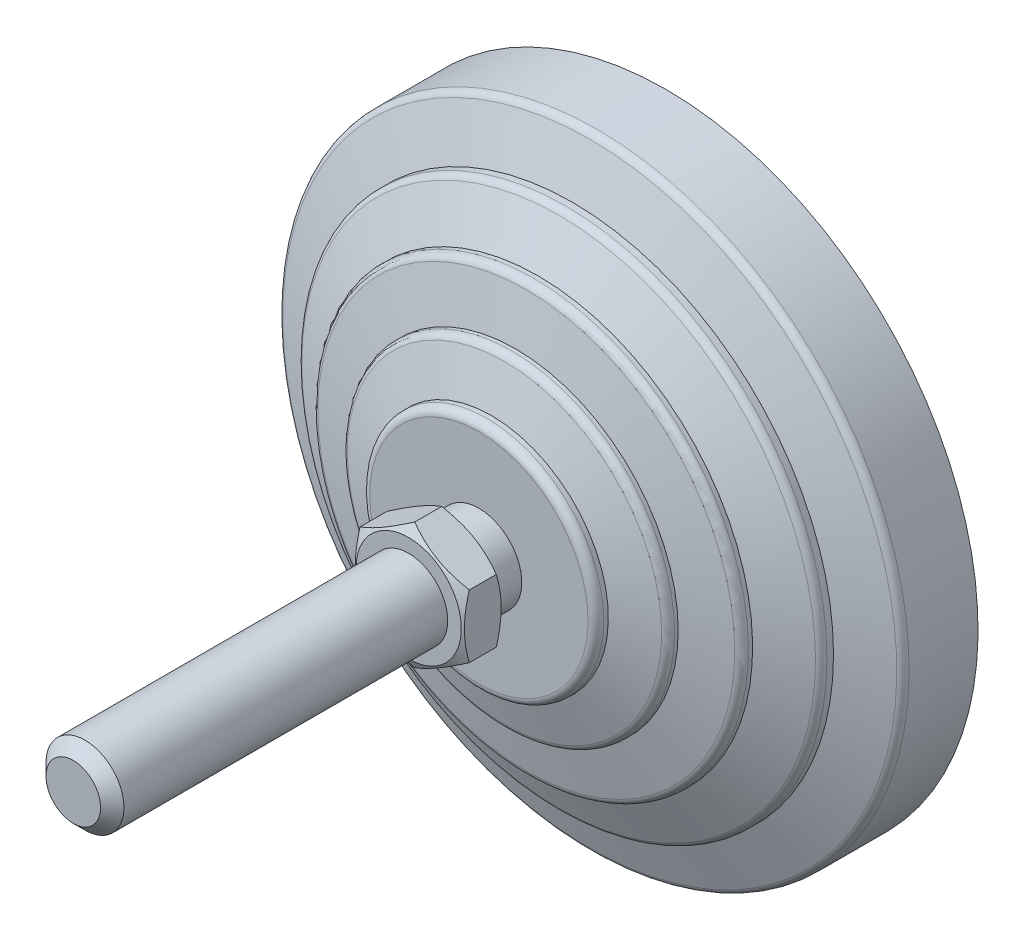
ISO-10303-21;
HEADER;
FILE_DESCRIPTION(('STEP AP214'),'2;1');
FILE_NAME('part.step','',(''),(''),'','','');
FILE_SCHEMA(('AUTOMOTIVE_DESIGN { 1 0 10303 214 1 1 1 1 }'));
ENDSEC;
DATA;
#1=APPLICATION_CONTEXT('core data for automotive mechanical design processes');
#2=APPLICATION_PROTOCOL_DEFINITION('international standard','automotive_design',2000,#1);
#3=PRODUCT_CONTEXT('',#1,'mechanical');
#4=PRODUCT('Part','Part','',(#3));
#5=PRODUCT_RELATED_PRODUCT_CATEGORY('part','',(#4));
#6=PRODUCT_DEFINITION_FORMATION('','',#4);
#7=PRODUCT_DEFINITION_CONTEXT('part definition',#1,'design');
#8=PRODUCT_DEFINITION('design','',#6,#7);
#9=PRODUCT_DEFINITION_SHAPE('','',#8);
#10=(LENGTH_UNIT() NAMED_UNIT(*) SI_UNIT(.MILLI.,.METRE.));
#11=(NAMED_UNIT(*) PLANE_ANGLE_UNIT() SI_UNIT($,.RADIAN.));
#12=(NAMED_UNIT(*) SI_UNIT($,.STERADIAN.) SOLID_ANGLE_UNIT());
#13=UNCERTAINTY_MEASURE_WITH_UNIT(LENGTH_MEASURE(1.E-05),#10,'distance_accuracy_value','');
#14=(GEOMETRIC_REPRESENTATION_CONTEXT(3) GLOBAL_UNCERTAINTY_ASSIGNED_CONTEXT((#13)) GLOBAL_UNIT_ASSIGNED_CONTEXT((#10,
#11,#12)) REPRESENTATION_CONTEXT('',''));
#15=CARTESIAN_POINT('',(0.,0.,0.));
#16=DIRECTION('',(0.,0.,1.));
#17=DIRECTION('',(1.,0.,0.));
#18=AXIS2_PLACEMENT_3D('',#15,#16,#17);
#19=CARTESIAN_POINT('',(-5.50000000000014,0.,28.));
#20=DIRECTION('',(0.,0.,1.));
#21=DIRECTION('',(0.,-1.,0.));
#22=AXIS2_PLACEMENT_3D('',#19,#20,#21);
#23=PLANE('',#22);
#24=CARTESIAN_POINT('',(0.,0.,28.));
#25=DIRECTION('',(0.,0.,-1.));
#26=DIRECTION('',(-1.,0.,0.));
#27=AXIS2_PLACEMENT_3D('',#24,#25,#26);
#28=CIRCLE('',#27,6.75);
#29=CARTESIAN_POINT('',(-6.75,0.,28.));
#30=VERTEX_POINT('',#29);
#31=EDGE_CURVE('E311',#30,#30,#28,.T.);
#32=ORIENTED_EDGE('',*,*,#31,.T.);
#33=EDGE_LOOP('',(#32));
#34=FACE_BOUND('',#33,.T.);
#35=CARTESIAN_POINT('',(0.,0.,28.));
#36=DIRECTION('',(0.,0.,-1.));
#37=DIRECTION('',(0.,1.,0.));
#38=AXIS2_PLACEMENT_3D('',#35,#36,#37);
#39=CIRCLE('',#38,5.50000000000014);
#40=CARTESIAN_POINT('',(0.,5.50000000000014,28.));
#41=VERTEX_POINT('',#40);
#42=EDGE_CURVE('E150',#41,#41,#39,.T.);
#43=ORIENTED_EDGE('',*,*,#42,.F.);
#44=EDGE_LOOP('',(#43));
#45=FACE_BOUND('',#44,.T.);
#46=ADVANCED_FACE('F14',(#34,#45),#23,.F.);
#47=CARTESIAN_POINT('',(0.,0.,0.));
#48=DIRECTION('',(0.,0.,-1.));
#49=DIRECTION('',(0.,1.,0.));
#50=AXIS2_PLACEMENT_3D('',#47,#48,#49);
#51=CYLINDRICAL_SURFACE('',#50,5.50000000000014);
#52=CARTESIAN_POINT('',(0.,0.,24.));
#53=DIRECTION('',(0.,0.,-1.));
#54=DIRECTION('',(0.,1.,0.));
#55=AXIS2_PLACEMENT_3D('',#52,#53,#54);
#56=CIRCLE('',#55,5.50000000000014);
#57=CARTESIAN_POINT('',(0.,5.50000000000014,24.));
#58=VERTEX_POINT('',#57);
#59=EDGE_CURVE('E147',#58,#58,#56,.T.);
#60=ORIENTED_EDGE('',*,*,#59,.F.);
#61=EDGE_LOOP('',(#60));
#62=FACE_BOUND('',#61,.T.);
#63=ORIENTED_EDGE('',*,*,#42,.T.);
#64=EDGE_LOOP('',(#63));
#65=FACE_BOUND('',#64,.T.);
#66=ADVANCED_FACE('F178',(#62,#65),#51,.T.);
#67=CARTESIAN_POINT('',(-5.50000000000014,0.,24.));
#68=DIRECTION('',(0.,0.,-1.));
#69=DIRECTION('',(0.,1.,0.));
#70=AXIS2_PLACEMENT_3D('',#67,#68,#69);
#71=PLANE('',#70);
#72=CARTESIAN_POINT('',(0.,0.,24.));
#73=DIRECTION('',(0.,0.,-1.));
#74=DIRECTION('',(0.,1.,0.));
#75=AXIS2_PLACEMENT_3D('',#72,#73,#74);
#76=CIRCLE('',#75,14.);
#77=CARTESIAN_POINT('',(0.,14.,24.));
#78=VERTEX_POINT('',#77);
#79=EDGE_CURVE('E144',#78,#78,#76,.T.);
#80=ORIENTED_EDGE('',*,*,#79,.F.);
#81=EDGE_LOOP('',(#80));
#82=FACE_BOUND('',#81,.T.);
#83=ORIENTED_EDGE('',*,*,#59,.T.);
#84=EDGE_LOOP('',(#83));
#85=FACE_BOUND('',#84,.T.);
#86=ADVANCED_FACE('F185',(#82,#85),#71,.F.);
#87=CARTESIAN_POINT('',(0.,0.,23.));
#88=DIRECTION('',(0.,0.,-1.));
#89=DIRECTION('',(0.,1.,0.));
#90=AXIS2_PLACEMENT_3D('',#87,#88,#89);
#91=TOROIDAL_SURFACE('',#90,14.,1.);
#92=CARTESIAN_POINT('',(0.,0.,23.));
#93=DIRECTION('',(0.,0.,-1.));
#94=DIRECTION('',(0.,1.,0.));
#95=AXIS2_PLACEMENT_3D('',#92,#93,#94);
#96=CIRCLE('',#95,15.);
#97=CARTESIAN_POINT('',(0.,15.,23.));
#98=VERTEX_POINT('',#97);
#99=EDGE_CURVE('E141',#98,#98,#96,.T.);
#100=ORIENTED_EDGE('',*,*,#99,.F.);
#101=EDGE_LOOP('',(#100));
#102=FACE_BOUND('',#101,.T.);
#103=ORIENTED_EDGE('',*,*,#79,.T.);
#104=EDGE_LOOP('',(#103));
#105=FACE_BOUND('',#104,.T.);
#106=ADVANCED_FACE('F524',(#102,#105),#91,.T.);
#107=CARTESIAN_POINT('',(0.,0.,0.));
#108=DIRECTION('',(0.,0.,-1.));
#109=DIRECTION('',(0.,1.,0.));
#110=AXIS2_PLACEMENT_3D('',#107,#108,#109);
#111=CYLINDRICAL_SURFACE('',#110,15.);
#112=CARTESIAN_POINT('',(0.,0.,22.4025287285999));
#113=DIRECTION('',(0.,0.,-1.));
#114=DIRECTION('',(0.,1.,0.));
#115=AXIS2_PLACEMENT_3D('',#112,#113,#114);
#116=CIRCLE('',#115,15.);
#117=CARTESIAN_POINT('',(0.,15.,22.4025287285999));
#118=VERTEX_POINT('',#117);
#119=EDGE_CURVE('E138',#118,#118,#116,.T.);
#120=ORIENTED_EDGE('',*,*,#119,.F.);
#121=EDGE_LOOP('',(#120));
#122=FACE_BOUND('',#121,.T.);
#123=ORIENTED_EDGE('',*,*,#99,.T.);
#124=EDGE_LOOP('',(#123));
#125=FACE_BOUND('',#124,.T.);
#126=ADVANCED_FACE('F515',(#122,#125),#111,.T.);
#127=CARTESIAN_POINT('',(0.,0.,22.4025287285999));
#128=DIRECTION('',(0.,0.,-1.));
#129=DIRECTION('',(0.,1.,0.));
#130=AXIS2_PLACEMENT_3D('',#127,#128,#129);
#131=CONICAL_SURFACE('',#130,15.,1.25589726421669);
#132=CARTESIAN_POINT('',(0.,0.,20.7216684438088));
#133=DIRECTION('',(0.,0.,-1.));
#134=DIRECTION('',(0.,1.,0.));
#135=AXIS2_PLACEMENT_3D('',#132,#133,#134);
#136=CIRCLE('',#135,20.1601635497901);
#137=CARTESIAN_POINT('',(0.,20.1601635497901,20.7216684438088));
#138=VERTEX_POINT('',#137);
#139=EDGE_CURVE('E135',#138,#138,#136,.T.);
#140=ORIENTED_EDGE('',*,*,#139,.F.);
#141=EDGE_LOOP('',(#140));
#142=FACE_BOUND('',#141,.T.);
#143=ORIENTED_EDGE('',*,*,#119,.T.);
#144=EDGE_LOOP('',(#143));
#145=FACE_BOUND('',#144,.T.);
#146=ADVANCED_FACE('F506',(#142,#145),#131,.T.);
#147=CARTESIAN_POINT('',(0.,0.,19.7708407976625));
#148=DIRECTION('',(0.,0.,-1.));
#149=DIRECTION('',(0.,1.,0.));
#150=AXIS2_PLACEMENT_3D('',#147,#148,#149);
#151=TOROIDAL_SURFACE('',#150,19.8504430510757,1.);
#152=CARTESIAN_POINT('',(0.,0.,19.7708407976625));
#153=DIRECTION('',(0.,0.,-1.));
#154=DIRECTION('',(0.,1.,0.));
#155=AXIS2_PLACEMENT_3D('',#152,#153,#154);
#156=CIRCLE('',#155,20.8504430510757);
#157=CARTESIAN_POINT('',(0.,20.8504430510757,19.7708407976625));
#158=VERTEX_POINT('',#157);
#159=EDGE_CURVE('E132',#158,#158,#156,.T.);
#160=ORIENTED_EDGE('',*,*,#159,.F.);
#161=EDGE_LOOP('',(#160));
#162=FACE_BOUND('',#161,.T.);
#163=ORIENTED_EDGE('',*,*,#139,.T.);
#164=EDGE_LOOP('',(#163));
#165=FACE_BOUND('',#164,.T.);
#166=ADVANCED_FACE('F497',(#162,#165),#151,.T.);
#167=CARTESIAN_POINT('',(0.,0.,0.));
#168=DIRECTION('',(0.,0.,-1.));
#169=DIRECTION('',(0.,1.,0.));
#170=AXIS2_PLACEMENT_3D('',#167,#168,#169);
#171=CYLINDRICAL_SURFACE('',#170,20.8504430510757);
#172=CARTESIAN_POINT('',(0.,0.,19.2987385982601));
#173=DIRECTION('',(0.,0.,-1.));
#174=DIRECTION('',(0.,1.,0.));
#175=AXIS2_PLACEMENT_3D('',#172,#173,#174);
#176=CIRCLE('',#175,20.8504430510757);
#177=CARTESIAN_POINT('',(0.,20.8504430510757,19.2987385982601));
#178=VERTEX_POINT('',#177);
#179=EDGE_CURVE('E129',#178,#178,#176,.T.);
#180=ORIENTED_EDGE('',*,*,#179,.F.);
#181=EDGE_LOOP('',(#180));
#182=FACE_BOUND('',#181,.T.);
#183=ORIENTED_EDGE('',*,*,#159,.T.);
#184=EDGE_LOOP('',(#183));
#185=FACE_BOUND('',#184,.T.);
#186=ADVANCED_FACE('F488',(#182,#185),#171,.T.);
#187=CARTESIAN_POINT('',(0.,0.,19.2987385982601));
#188=DIRECTION('',(0.,0.,-1.));
#189=DIRECTION('',(0.,1.,0.));
#190=AXIS2_PLACEMENT_3D('',#187,#188,#189);
#191=CONICAL_SURFACE('',#190,20.8504430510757,1.34067144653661);
#192=CARTESIAN_POINT('',(0.,0.,17.9217501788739));
#193=DIRECTION('',(0.,0.,-1.));
#194=DIRECTION('',(0.,1.,0.));
#195=AXIS2_PLACEMENT_3D('',#192,#193,#194);
#196=CIRCLE('',#195,26.7280991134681);
#197=CARTESIAN_POINT('',(0.,26.7280991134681,17.9217501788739));
#198=VERTEX_POINT('',#197);
#199=EDGE_CURVE('E126',#198,#198,#196,.T.);
#200=ORIENTED_EDGE('',*,*,#199,.F.);
#201=EDGE_LOOP('',(#200));
#202=FACE_BOUND('',#201,.T.);
#203=ORIENTED_EDGE('',*,*,#179,.T.);
#204=EDGE_LOOP('',(#203));
#205=FACE_BOUND('',#204,.T.);
#206=ADVANCED_FACE('F479',(#202,#205),#191,.T.);
#207=CARTESIAN_POINT('',(0.,0.,16.9481122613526));
#208=DIRECTION('',(0.,0.,-1.));
#209=DIRECTION('',(0.,1.,0.));
#210=AXIS2_PLACEMENT_3D('',#207,#208,#209);
#211=TOROIDAL_SURFACE('',#210,26.5,1.);
#212=CARTESIAN_POINT('',(0.,0.,16.9481122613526));
#213=DIRECTION('',(0.,0.,-1.));
#214=DIRECTION('',(0.,1.,0.));
#215=AXIS2_PLACEMENT_3D('',#212,#213,#214);
#216=CIRCLE('',#215,27.5);
#217=CARTESIAN_POINT('',(0.,27.5,16.9481122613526));
#218=VERTEX_POINT('',#217);
#219=EDGE_CURVE('E123',#218,#218,#216,.T.);
#220=ORIENTED_EDGE('',*,*,#219,.F.);
#221=EDGE_LOOP('',(#220));
#222=FACE_BOUND('',#221,.T.);
#223=ORIENTED_EDGE('',*,*,#199,.T.);
#224=EDGE_LOOP('',(#223));
#225=FACE_BOUND('',#224,.T.);
#226=ADVANCED_FACE('F470',(#222,#225),#211,.T.);
#227=CARTESIAN_POINT('',(0.,0.,0.));
#228=DIRECTION('',(0.,0.,-1.));
#229=DIRECTION('',(0.,1.,0.));
#230=AXIS2_PLACEMENT_3D('',#227,#228,#229);
#231=CYLINDRICAL_SURFACE('',#230,27.5);
#232=CARTESIAN_POINT('',(0.,0.,16.4025287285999));
#233=DIRECTION('',(0.,0.,-1.));
#234=DIRECTION('',(0.,1.,0.));
#235=AXIS2_PLACEMENT_3D('',#232,#233,#234);
#236=CIRCLE('',#235,27.5);
#237=CARTESIAN_POINT('',(0.,27.5,16.4025287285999));
#238=VERTEX_POINT('',#237);
#239=EDGE_CURVE('E120',#238,#238,#236,.T.);
#240=ORIENTED_EDGE('',*,*,#239,.F.);
#241=EDGE_LOOP('',(#240));
#242=FACE_BOUND('',#241,.T.);
#243=ORIENTED_EDGE('',*,*,#219,.T.);
#244=EDGE_LOOP('',(#243));
#245=FACE_BOUND('',#244,.T.);
#246=ADVANCED_FACE('F461',(#242,#245),#231,.T.);
#247=CARTESIAN_POINT('',(0.,0.,16.4025287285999));
#248=DIRECTION('',(0.,0.,-1.));
#249=DIRECTION('',(0.,1.,0.));
#250=AXIS2_PLACEMENT_3D('',#247,#248,#249);
#251=CONICAL_SURFACE('',#250,27.5,1.12022914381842);
#252=CARTESIAN_POINT('',(0.,0.,13.7730910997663));
#253=DIRECTION('',(0.,0.,-1.));
#254=DIRECTION('',(0.,1.,0.));
#255=AXIS2_PLACEMENT_3D('',#252,#253,#254);
#256=CIRCLE('',#255,32.9354761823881);
#257=CARTESIAN_POINT('',(0.,32.9354761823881,13.7730910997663));
#258=VERTEX_POINT('',#257);
#259=EDGE_CURVE('E117',#258,#258,#256,.T.);
#260=ORIENTED_EDGE('',*,*,#259,.F.);
#261=EDGE_LOOP('',(#260));
#262=FACE_BOUND('',#261,.T.);
#263=ORIENTED_EDGE('',*,*,#239,.T.);
#264=EDGE_LOOP('',(#263));
#265=FACE_BOUND('',#264,.T.);
#266=ADVANCED_FACE('F452',(#262,#265),#251,.T.);
#267=CARTESIAN_POINT('',(0.,0.,12.872890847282));
#268=DIRECTION('',(0.,0.,-1.));
#269=DIRECTION('',(0.,1.,0.));
#270=AXIS2_PLACEMENT_3D('',#267,#268,#269);
#271=TOROIDAL_SURFACE('',#270,32.5,1.);
#272=CARTESIAN_POINT('',(0.,0.,12.872890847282));
#273=DIRECTION('',(0.,0.,-1.));
#274=DIRECTION('',(0.,1.,0.));
#275=AXIS2_PLACEMENT_3D('',#272,#273,#274);
#276=CIRCLE('',#275,33.5);
#277=CARTESIAN_POINT('',(0.,33.5,12.872890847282));
#278=VERTEX_POINT('',#277);
#279=EDGE_CURVE('E114',#278,#278,#276,.T.);
#280=ORIENTED_EDGE('',*,*,#279,.F.);
#281=EDGE_LOOP('',(#280));
#282=FACE_BOUND('',#281,.T.);
#283=ORIENTED_EDGE('',*,*,#259,.T.);
#284=EDGE_LOOP('',(#283));
#285=FACE_BOUND('',#284,.T.);
#286=ADVANCED_FACE('F443',(#282,#285),#271,.T.);
#287=CARTESIAN_POINT('',(0.,0.,0.));
#288=DIRECTION('',(0.,0.,-1.));
#289=DIRECTION('',(0.,1.,0.));
#290=AXIS2_PLACEMENT_3D('',#287,#288,#289);
#291=CYLINDRICAL_SURFACE('',#290,33.5);
#292=CARTESIAN_POINT('',(0.,0.,12.0315037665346));
#293=DIRECTION('',(0.,0.,-1.));
#294=DIRECTION('',(0.,1.,0.));
#295=AXIS2_PLACEMENT_3D('',#292,#293,#294);
#296=CIRCLE('',#295,33.5);
#297=CARTESIAN_POINT('',(0.,33.5,12.0315037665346));
#298=VERTEX_POINT('',#297);
#299=EDGE_CURVE('E111',#298,#298,#296,.T.);
#300=ORIENTED_EDGE('',*,*,#299,.F.);
#301=EDGE_LOOP('',(#300));
#302=FACE_BOUND('',#301,.T.);
#303=ORIENTED_EDGE('',*,*,#279,.T.);
#304=EDGE_LOOP('',(#303));
#305=FACE_BOUND('',#304,.T.);
#306=ADVANCED_FACE('F434',(#302,#305),#291,.T.);
#307=CARTESIAN_POINT('',(0.,0.,12.0315037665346));
#308=DIRECTION('',(0.,0.,-1.));
#309=DIRECTION('',(0.,1.,0.));
#310=AXIS2_PLACEMENT_3D('',#307,#308,#309);
#311=CONICAL_SURFACE('',#310,33.5,1.20362249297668);
#312=CARTESIAN_POINT('',(0.,0.,9.77805027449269));
#313=DIRECTION('',(0.,0.,-1.));
#314=DIRECTION('',(0.,1.,0.));
#315=AXIS2_PLACEMENT_3D('',#312,#313,#314);
#316=CIRCLE('',#315,39.358979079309);
#317=CARTESIAN_POINT('',(0.,39.358979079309,9.77805027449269));
#318=VERTEX_POINT('',#317);
#319=EDGE_CURVE('E108',#318,#318,#316,.T.);
#320=ORIENTED_EDGE('',*,*,#319,.F.);
#321=EDGE_LOOP('',(#320));
#322=FACE_BOUND('',#321,.T.);
#323=ORIENTED_EDGE('',*,*,#299,.T.);
#324=EDGE_LOOP('',(#323));
#325=FACE_BOUND('',#324,.T.);
#326=ADVANCED_FACE('F425',(#322,#325),#311,.T.);
#327=CARTESIAN_POINT('',(0.,0.,8.84470466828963));
#328=DIRECTION('',(0.,0.,-1.));
#329=DIRECTION('',(0.,1.,0.));
#330=AXIS2_PLACEMENT_3D('',#327,#328,#329);
#331=TOROIDAL_SURFACE('',#330,39.,1.);
#332=CARTESIAN_POINT('',(0.,0.,8.84470466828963));
#333=DIRECTION('',(0.,0.,-1.));
#334=DIRECTION('',(0.,1.,0.));
#335=AXIS2_PLACEMENT_3D('',#332,#333,#334);
#336=CIRCLE('',#335,40.);
#337=CARTESIAN_POINT('',(0.,40.,8.84470466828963));
#338=VERTEX_POINT('',#337);
#339=EDGE_CURVE('E105',#338,#338,#336,.T.);
#340=ORIENTED_EDGE('',*,*,#339,.F.);
#341=EDGE_LOOP('',(#340));
#342=FACE_BOUND('',#341,.T.);
#343=ORIENTED_EDGE('',*,*,#319,.T.);
#344=EDGE_LOOP('',(#343));
#345=FACE_BOUND('',#344,.T.);
#346=ADVANCED_FACE('F416',(#342,#345),#331,.T.);
#347=CARTESIAN_POINT('',(0.,0.,0.));
#348=DIRECTION('',(0.,0.,-1.));
#349=DIRECTION('',(0.,1.,0.));
#350=AXIS2_PLACEMENT_3D('',#347,#348,#349);
#351=CYLINDRICAL_SURFACE('',#350,40.);
#352=CARTESIAN_POINT('',(0.,0.,0.));
#353=DIRECTION('',(0.,0.,-1.));
#354=DIRECTION('',(0.,1.,0.));
#355=AXIS2_PLACEMENT_3D('',#352,#353,#354);
#356=CIRCLE('',#355,40.);
#357=CARTESIAN_POINT('',(0.,40.,0.));
#358=VERTEX_POINT('',#357);
#359=EDGE_CURVE('E102',#358,#358,#356,.T.);
#360=ORIENTED_EDGE('',*,*,#359,.F.);
#361=EDGE_LOOP('',(#360));
#362=FACE_BOUND('',#361,.T.);
#363=ORIENTED_EDGE('',*,*,#339,.T.);
#364=EDGE_LOOP('',(#363));
#365=FACE_BOUND('',#364,.T.);
#366=ADVANCED_FACE('F409',(#362,#365),#351,.T.);
#367=CARTESIAN_POINT('',(0.,0.,0.));
#368=DIRECTION('',(0.,0.,1.));
#369=DIRECTION('',(0.,-1.,0.));
#370=AXIS2_PLACEMENT_3D('',#367,#368,#369);
#371=PLANE('',#370);
#372=ORIENTED_EDGE('',*,*,#359,.T.);
#373=EDGE_LOOP('',(#372));
#374=FACE_BOUND('',#373,.T.);
#375=ADVANCED_FACE('F175',(#374),#371,.F.);
#376=CARTESIAN_POINT('',(0.,0.,29.4286933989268));
#377=DIRECTION('',(0.,0.,1.));
#378=DIRECTION('',(1.,0.,0.));
#379=AXIS2_PLACEMENT_3D('',#376,#377,#378);
#380=CONICAL_SURFACE('',#379,9.22456955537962,1.0471975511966);
#381=CARTESIAN_POINT('',(0.000200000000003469,-8.0830192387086,28.7696190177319));
#382=CARTESIAN_POINT('',(-0.153667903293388,-7.99418356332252,28.7183374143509));
#383=CARTESIAN_POINT('',(-0.308109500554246,-7.90501666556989,28.669383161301));
#384=CARTESIAN_POINT('',(-0.618246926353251,-7.72595873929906,28.5767703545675));
#385=CARTESIAN_POINT('',(-0.773943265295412,-7.63606741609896,28.5331140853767));
#386=CARTESIAN_POINT('',(-1.24352516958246,-7.36495417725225,28.4109491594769));
#387=CARTESIAN_POINT('',(-1.5592643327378,-7.18266208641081,28.3414631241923));
#388=CARTESIAN_POINT('',(-2.03176224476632,-6.90986528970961,28.2599825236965));
#389=CARTESIAN_POINT('',(-2.18710922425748,-6.82017566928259,28.2367710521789));
#390=CARTESIAN_POINT('',(-2.49850511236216,-6.64039116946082,28.1978487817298));
#391=CARTESIAN_POINT('',(-2.6545539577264,-6.55029632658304,28.1821373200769));
#392=CARTESIAN_POINT('',(-2.96692267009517,-6.36995016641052,28.1586154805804));
#393=CARTESIAN_POINT('',(-3.12324202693,-6.27969914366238,28.1507961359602));
#394=CARTESIAN_POINT('',(-3.43601650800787,-6.09911871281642,28.1432178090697));
#395=CARTESIAN_POINT('',(-3.59247162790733,-6.00878930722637,28.1434585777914));
#396=CARTESIAN_POINT('',(-4.02110687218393,-5.76131663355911,28.155197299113));
#397=CARTESIAN_POINT('',(-4.2931466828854,-5.60425437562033,28.1749033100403));
#398=CARTESIAN_POINT('',(-4.8354194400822,-5.29117305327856,28.2373910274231));
#399=CARTESIAN_POINT('',(-5.10565047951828,-5.13515508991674,28.2801940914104));
#400=CARTESIAN_POINT('',(-5.64901454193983,-4.82144370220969,28.3871892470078));
#401=CARTESIAN_POINT('',(-5.92207900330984,-4.6637898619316,28.4518346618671));
#402=CARTESIAN_POINT('',(-6.46413578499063,-4.35083323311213,28.5985536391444));
#403=CARTESIAN_POINT('',(-6.73313504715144,-4.19552643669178,28.680592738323));
#404=CARTESIAN_POINT('',(-7.0002,-4.04133641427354,28.7696190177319));
#405=B_SPLINE_CURVE_WITH_KNOTS('',3,(#381,#382,#383,#384,#385,#386,#387,#388,#389,#390,#391,
#392,#393,#394,#395,#396,#397,#398,#399,#400,#401,#402,#403,#404),.UNSPECIFIED.,.F.,.F.,(4,2,2,
2,2,2,2,2,2,2,2,4),(0.,0.554727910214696,1.10969417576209,2.2219327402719,2.76443041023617,
3.30688013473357,3.8487128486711,4.39052882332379,5.33376515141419,6.27787517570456,
7.2429241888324,8.20607866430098),.UNSPECIFIED.);
#406=CARTESIAN_POINT('',(0.,-8.08290376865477,28.7695523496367));
#407=VERTEX_POINT('',#406);
#408=CARTESIAN_POINT('',(-7.,-4.04145188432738,28.7695523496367));
#409=VERTEX_POINT('',#408);
#410=EDGE_CURVE('E73',#407,#409,#405,.T.);
#411=ORIENTED_EDGE('',*,*,#410,.T.);
#412=CARTESIAN_POINT('',(-7.,-10.7900951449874,31.528655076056));
#413=CARTESIAN_POINT('',(-7.,-10.4849024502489,31.3808748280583));
#414=CARTESIAN_POINT('',(-7.,-10.1790020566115,31.2345307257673));
#415=CARTESIAN_POINT('',(-7.,-9.56540924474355,30.9455238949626));
#416=CARTESIAN_POINT('',(-7.,-9.25771654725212,30.8028617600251));
#417=CARTESIAN_POINT('',(-7.,-8.63854540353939,30.5212960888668));
#418=CARTESIAN_POINT('',(-7.,-8.3270554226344,30.3824178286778));
#419=CARTESIAN_POINT('',(-7.,-7.70157486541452,30.1104333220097));
#420=CARTESIAN_POINT('',(-7.,-7.38758441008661,29.9773267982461));
#421=CARTESIAN_POINT('',(-7.,-6.74672897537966,29.7143600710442));
#422=CARTESIAN_POINT('',(-7.,-6.4197684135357,29.5847314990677));
#423=CARTESIAN_POINT('',(-7.,-5.76199866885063,29.3354452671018));
#424=CARTESIAN_POINT('',(-7.,-5.43118905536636,29.2157887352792));
#425=CARTESIAN_POINT('',(-7.,-4.76583163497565,28.9896364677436));
#426=CARTESIAN_POINT('',(-7.,-4.4312931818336,28.8831135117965));
#427=CARTESIAN_POINT('',(-7.,-3.75743050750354,28.6866882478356));
#428=CARTESIAN_POINT('',(-7.,-3.41810785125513,28.5967806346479));
#429=CARTESIAN_POINT('',(-7.,-2.73629578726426,28.4384240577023));
#430=CARTESIAN_POINT('',(-7.,-2.39383353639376,28.369861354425));
#431=CARTESIAN_POINT('',(-7.,-1.87707490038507,28.2860273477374));
#432=CARTESIAN_POINT('',(-7.,-1.70429794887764,28.2612498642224));
#433=CARTESIAN_POINT('',(-7.,-1.35790780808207,28.2185190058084));
#434=CARTESIAN_POINT('',(-7.,-1.18429470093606,28.2005649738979));
#435=CARTESIAN_POINT('',(-7.,-0.838703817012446,28.1720605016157));
#436=CARTESIAN_POINT('',(-7.,-0.666733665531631,28.1614179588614));
#437=CARTESIAN_POINT('',(-7.,-0.322497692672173,28.1474100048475));
#438=CARTESIAN_POINT('',(-7.,-0.150231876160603,28.1440444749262));
#439=CARTESIAN_POINT('',(-7.,0.194288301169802,28.144670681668));
#440=CARTESIAN_POINT('',(-7.,0.366542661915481,28.148662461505));
#441=CARTESIAN_POINT('',(-7.,0.710732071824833,28.1639068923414));
#442=CARTESIAN_POINT('',(-7.,0.882667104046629,28.1751599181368));
#443=CARTESIAN_POINT('',(-7.,1.29789329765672,28.2108685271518));
#444=CARTESIAN_POINT('',(-7.,1.54088481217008,28.2388810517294));
#445=CARTESIAN_POINT('',(-7.,2.02500942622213,28.3078655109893));
#446=CARTESIAN_POINT('',(-7.,2.26614226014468,28.3488392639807));
#447=CARTESIAN_POINT('',(-7.,2.98650792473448,28.4890249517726));
#448=CARTESIAN_POINT('',(-7.,3.46242764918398,28.6054740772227));
#449=CARTESIAN_POINT('',(-7.,4.1739701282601,28.8067137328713));
#450=CARTESIAN_POINT('',(-7.,4.41330084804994,28.8791417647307));
#451=CARTESIAN_POINT('',(-7.,4.88963661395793,29.0313474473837));
#452=CARTESIAN_POINT('',(-7.,5.12664164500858,29.1111251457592));
#453=CARTESIAN_POINT('',(-7.,5.59840396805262,29.2767645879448));
#454=CARTESIAN_POINT('',(-7.,5.83316201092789,29.3626242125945));
#455=CARTESIAN_POINT('',(-7.,6.30074476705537,29.539434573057));
#456=CARTESIAN_POINT('',(-7.,6.53356950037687,29.6303852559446));
#457=CARTESIAN_POINT('',(-7.,7.07225287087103,29.8465215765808));
#458=CARTESIAN_POINT('',(-7.,7.3774728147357,29.9732958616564));
#459=CARTESIAN_POINT('',(-7.,7.98540932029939,30.2327275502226));
#460=CARTESIAN_POINT('',(-7.,8.28812574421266,30.3653852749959));
#461=CARTESIAN_POINT('',(-7.,8.89150184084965,30.6354320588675));
#462=CARTESIAN_POINT('',(-7.,9.19216112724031,30.7728219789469));
#463=CARTESIAN_POINT('',(-7.,9.79171290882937,31.0514107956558));
#464=CARTESIAN_POINT('',(-7.,10.0906053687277,31.1926097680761));
#465=CARTESIAN_POINT('',(-7.,10.6871963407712,31.4782580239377));
#466=CARTESIAN_POINT('',(-7.,10.9848933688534,31.6227104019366));
#467=CARTESIAN_POINT('',(-7.,11.5790258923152,31.9141889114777));
#468=CARTESIAN_POINT('',(-7.,11.8754613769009,32.0612150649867));
#469=CARTESIAN_POINT('',(-7.,12.7630981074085,32.5054492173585));
#470=CARTESIAN_POINT('',(-7.,13.3527023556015,32.8058480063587));
#471=CARTESIAN_POINT('',(-7.,14.4812767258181,33.3881590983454));
#472=CARTESIAN_POINT('',(-7.,15.0204890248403,33.6696040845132));
#473=CARTESIAN_POINT('',(-7.,16.0969020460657,34.2363536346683));
#474=CARTESIAN_POINT('',(-7.,16.6341027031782,34.5216583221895));
#475=CARTESIAN_POINT('',(-7.,17.7056729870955,35.0945481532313));
#476=CARTESIAN_POINT('',(-7.,18.2400462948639,35.3821264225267));
#477=CARTESIAN_POINT('',(-7.,19.3075003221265,35.9596072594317));
#478=CARTESIAN_POINT('',(-7.,19.840581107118,36.2495097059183));
#479=CARTESIAN_POINT('',(-7.,20.3731830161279,36.5402834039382));
#480=B_SPLINE_CURVE_WITH_KNOTS('',3,(#412,#413,#414,#415,#416,#417,#418,#419,#420,#421,#422,
#423,#424,#425,#426,#427,#428,#429,#430,#431,#432,#433,#434,#435,#436,#437,#438,#439,#440,#441,
#442,#443,#444,#445,#446,#447,#448,#449,#450,#451,#452,#453,#454,#455,#456,#457,#458,#459,#460,
#461,#462,#463,#464,#465,#466,#467,#468,#469,#470,#471,#472,#473,#474,#475,#476,#477,#478,#479),
.UNSPECIFIED.,.F.,.F.,(4,2,2,2,2,2,2,2,2,2,2,2,2,2,2,2,2,2,2,2,2,2,2,2,2,2,2,2,2,2,2,2,2,4),(0.,
1.01728077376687,2.03472453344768,3.05781919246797,4.08086464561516,5.1358977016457,
6.19104995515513,7.24397719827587,8.29656766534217,9.34344924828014,9.86696931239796,
10.3904389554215,10.9071872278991,11.4239270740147,11.9406699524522,12.4574395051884,
13.1908262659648,13.9243159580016,15.3921363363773,16.1422261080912,16.8923207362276,
17.6421552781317,18.3919820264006,19.3834031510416,20.3748784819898,21.3665351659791,
22.3582115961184,23.350874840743,24.3435465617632,26.3286477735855,28.1533640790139,
29.9781389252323,31.7986560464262,33.6190789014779),.UNSPECIFIED.);
#481=CARTESIAN_POINT('',(-7.,4.04145188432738,28.7695523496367));
#482=VERTEX_POINT('',#481);
#483=EDGE_CURVE('E81',#409,#482,#480,.T.);
#484=ORIENTED_EDGE('',*,*,#483,.T.);
#485=CARTESIAN_POINT('',(-7.0002,4.04133641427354,28.7696190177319));
#486=CARTESIAN_POINT('',(-6.84633209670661,4.13017208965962,28.7183374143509));
#487=CARTESIAN_POINT('',(-6.69189049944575,4.21933898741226,28.669383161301));
#488=CARTESIAN_POINT('',(-6.38175307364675,4.39839691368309,28.5767703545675));
#489=CARTESIAN_POINT('',(-6.22605673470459,4.48828823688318,28.5331140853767));
#490=CARTESIAN_POINT('',(-5.75647483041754,4.75940147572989,28.4109491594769));
#491=CARTESIAN_POINT('',(-5.4407356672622,4.94169356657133,28.3414631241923));
#492=CARTESIAN_POINT('',(-4.96823775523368,5.21449036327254,28.2599825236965));
#493=CARTESIAN_POINT('',(-4.81289077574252,5.30417998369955,28.2367710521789));
#494=CARTESIAN_POINT('',(-4.50149488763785,5.48396448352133,28.1978487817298));
#495=CARTESIAN_POINT('',(-4.3454460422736,5.5740593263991,28.1821373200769));
#496=CARTESIAN_POINT('',(-4.03307732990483,5.75440548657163,28.1586154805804));
#497=CARTESIAN_POINT('',(-3.87675797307,5.84465650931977,28.1507961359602));
#498=CARTESIAN_POINT('',(-3.56398349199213,6.02523694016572,28.1432178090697));
#499=CARTESIAN_POINT('',(-3.40752837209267,6.11556634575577,28.1434585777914));
#500=CARTESIAN_POINT('',(-2.97889312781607,6.36303901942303,28.155197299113));
#501=CARTESIAN_POINT('',(-2.70685331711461,6.52010127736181,28.1749033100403));
#502=CARTESIAN_POINT('',(-2.16458055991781,6.83318259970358,28.2373910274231));
#503=CARTESIAN_POINT('',(-1.89434952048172,6.9892005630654,28.2801940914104));
#504=CARTESIAN_POINT('',(-1.35098545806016,7.30291195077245,28.3871892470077));
#505=CARTESIAN_POINT('',(-1.07792099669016,7.46056579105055,28.451834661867));
#506=CARTESIAN_POINT('',(-0.53586421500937,7.77352241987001,28.5985536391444));
#507=CARTESIAN_POINT('',(-0.266864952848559,7.92882921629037,28.680592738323));
#508=CARTESIAN_POINT('',(0.000199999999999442,8.0830192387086,28.7696190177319));
#509=B_SPLINE_CURVE_WITH_KNOTS('',3,(#485,#486,#487,#488,#489,#490,#491,#492,#493,#494,#495,
#496,#497,#498,#499,#500,#501,#502,#503,#504,#505,#506,#507,#508),.UNSPECIFIED.,.F.,.F.,(4,2,2,
2,2,2,2,2,2,2,2,4),(0.,0.554727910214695,1.10969417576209,2.2219327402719,2.76443041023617,
3.30688013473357,3.84871284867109,4.39052882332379,5.33376515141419,6.27787517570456,
7.2429241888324,8.20607866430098),.UNSPECIFIED.);
#510=CARTESIAN_POINT('',(0.,8.08290376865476,28.7695523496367));
#511=VERTEX_POINT('',#510);
#512=EDGE_CURVE('E278',#482,#511,#509,.T.);
#513=ORIENTED_EDGE('',*,*,#512,.T.);
#514=CARTESIAN_POINT('',(-0.000200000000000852,8.0830192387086,28.7696190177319));
#515=CARTESIAN_POINT('',(0.153667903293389,7.99418356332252,28.7183374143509));
#516=CARTESIAN_POINT('',(0.308109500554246,7.90501666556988,28.669383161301));
#517=CARTESIAN_POINT('',(0.618246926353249,7.72595873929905,28.5767703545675));
#518=CARTESIAN_POINT('',(0.773943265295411,7.63606741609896,28.5331140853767));
#519=CARTESIAN_POINT('',(1.24352516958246,7.36495417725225,28.4109491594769));
#520=CARTESIAN_POINT('',(1.5592643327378,7.18266208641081,28.3414631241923));
#521=CARTESIAN_POINT('',(2.03176224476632,6.9098652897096,28.2599825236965));
#522=CARTESIAN_POINT('',(2.18710922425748,6.82017566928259,28.2367710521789));
#523=CARTESIAN_POINT('',(2.49850511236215,6.64039116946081,28.1978487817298));
#524=CARTESIAN_POINT('',(2.6545539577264,6.55029632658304,28.1821373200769));
#525=CARTESIAN_POINT('',(2.96692267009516,6.36995016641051,28.1586154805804));
#526=CARTESIAN_POINT('',(3.12324202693,6.27969914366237,28.1507961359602));
#527=CARTESIAN_POINT('',(3.43601650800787,6.09911871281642,28.1432178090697));
#528=CARTESIAN_POINT('',(3.59247162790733,6.00878930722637,28.1434585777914));
#529=CARTESIAN_POINT('',(4.02110687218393,5.76131663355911,28.155197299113));
#530=CARTESIAN_POINT('',(4.29314668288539,5.60425437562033,28.1749033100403));
#531=CARTESIAN_POINT('',(4.83541944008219,5.29117305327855,28.2373910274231));
#532=CARTESIAN_POINT('',(5.10565047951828,5.13515508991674,28.2801940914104));
#533=CARTESIAN_POINT('',(5.64901454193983,4.82144370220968,28.3871892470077));
#534=CARTESIAN_POINT('',(5.92207900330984,4.66378986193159,28.4518346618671));
#535=CARTESIAN_POINT('',(6.46413578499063,4.35083323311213,28.5985536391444));
#536=CARTESIAN_POINT('',(6.73313504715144,4.19552643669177,28.680592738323));
#537=CARTESIAN_POINT('',(7.0002,4.04133641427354,28.7696190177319));
#538=B_SPLINE_CURVE_WITH_KNOTS('',3,(#514,#515,#516,#517,#518,#519,#520,#521,#522,#523,#524,
#525,#526,#527,#528,#529,#530,#531,#532,#533,#534,#535,#536,#537),.UNSPECIFIED.,.F.,.F.,(4,2,2,
2,2,2,2,2,2,2,2,4),(0.,0.554727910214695,1.10969417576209,2.2219327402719,2.76443041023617,
3.30688013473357,3.84871284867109,4.39052882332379,5.33376515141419,6.27787517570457,
7.2429241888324,8.20607866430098),.UNSPECIFIED.);
#539=CARTESIAN_POINT('',(7.,4.04145188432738,28.7695523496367));
#540=VERTEX_POINT('',#539);
#541=EDGE_CURVE('E279',#511,#540,#538,.T.);
#542=ORIENTED_EDGE('',*,*,#541,.T.);
#543=CARTESIAN_POINT('',(7.,-10.7900951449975,31.5286550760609));
#544=CARTESIAN_POINT('',(7.,-10.4849024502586,31.380874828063));
#545=CARTESIAN_POINT('',(7.,-10.1790020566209,31.2345307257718));
#546=CARTESIAN_POINT('',(7.,-9.56540924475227,30.9455238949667));
#547=CARTESIAN_POINT('',(7.,-9.2577165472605,30.8028617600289));
#548=CARTESIAN_POINT('',(7.,-8.63854540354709,30.5212960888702));
#549=CARTESIAN_POINT('',(7.,-8.32705542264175,30.3824178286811));
#550=CARTESIAN_POINT('',(7.,-7.70157486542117,30.1104333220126));
#551=CARTESIAN_POINT('',(7.,-7.38758441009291,29.9773267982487));
#552=CARTESIAN_POINT('',(7.,-6.74672897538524,29.7143600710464));
#553=CARTESIAN_POINT('',(7.,-6.4197684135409,29.5847314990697));
#554=CARTESIAN_POINT('',(7.,-5.76199866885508,29.3354452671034));
#555=CARTESIAN_POINT('',(7.,-5.43118905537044,29.2157887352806));
#556=CARTESIAN_POINT('',(7.,-4.76583163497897,28.9896364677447));
#557=CARTESIAN_POINT('',(7.,-4.43129318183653,28.8831135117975));
#558=CARTESIAN_POINT('',(7.,-3.75743050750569,28.6866882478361));
#559=CARTESIAN_POINT('',(7.,-3.4181078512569,28.5967806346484));
#560=CARTESIAN_POINT('',(7.,-2.73629578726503,28.4384240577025));
#561=CARTESIAN_POINT('',(7.,-2.39383353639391,28.369861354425));
#562=CARTESIAN_POINT('',(7.,-1.87707490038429,28.2860273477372));
#563=CARTESIAN_POINT('',(7.,-1.70429794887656,28.2612498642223));
#564=CARTESIAN_POINT('',(7.,-1.35790780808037,28.2185190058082));
#565=CARTESIAN_POINT('',(7.,-1.18429470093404,28.2005649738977));
#566=CARTESIAN_POINT('',(7.,-0.838703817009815,28.1720605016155));
#567=CARTESIAN_POINT('',(7.,-0.666733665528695,28.1614179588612));
#568=CARTESIAN_POINT('',(7.,-0.322497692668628,28.1474100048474));
#569=CARTESIAN_POINT('',(7.,-0.150231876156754,28.1440444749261));
#570=CARTESIAN_POINT('',(7.,0.194288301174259,28.144670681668));
#571=CARTESIAN_POINT('',(7.,0.366542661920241,28.1486624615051));
#572=CARTESIAN_POINT('',(7.,0.710732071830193,28.1639068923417));
#573=CARTESIAN_POINT('',(7.,0.882667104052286,28.1751599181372));
#574=CARTESIAN_POINT('',(7.,1.29789329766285,28.2108685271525));
#575=CARTESIAN_POINT('',(7.,1.54088481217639,28.2388810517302));
#576=CARTESIAN_POINT('',(7.,2.02500942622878,28.3078655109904));
#577=CARTESIAN_POINT('',(7.,2.26614226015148,28.3488392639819));
#578=CARTESIAN_POINT('',(7.,2.98650792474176,28.4890249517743));
#579=CARTESIAN_POINT('',(7.,3.46242764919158,28.6054740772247));
#580=CARTESIAN_POINT('',(7.,4.17397012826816,28.8067137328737));
#581=CARTESIAN_POINT('',(7.,4.41330084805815,28.8791417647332));
#582=CARTESIAN_POINT('',(7.,4.88963661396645,29.0313474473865));
#583=CARTESIAN_POINT('',(7.,5.12664164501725,29.1111251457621));
#584=CARTESIAN_POINT('',(7.,5.59840396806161,29.2767645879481));
#585=CARTESIAN_POINT('',(7.,5.83316201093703,29.3626242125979));
#586=CARTESIAN_POINT('',(7.,6.30074476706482,29.5394345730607));
#587=CARTESIAN_POINT('',(7.,6.53356950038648,29.6303852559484));
#588=CARTESIAN_POINT('',(7.,7.07225287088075,29.8465215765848));
#589=CARTESIAN_POINT('',(7.,7.37747281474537,29.9732958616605));
#590=CARTESIAN_POINT('',(7.,7.98540932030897,30.2327275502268));
#591=CARTESIAN_POINT('',(7.,8.2881257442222,30.3653852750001));
#592=CARTESIAN_POINT('',(7.,8.89150184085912,30.6354320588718));
#593=CARTESIAN_POINT('',(7.,9.19216112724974,30.7728219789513));
#594=CARTESIAN_POINT('',(7.,9.79171290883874,31.0514107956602));
#595=CARTESIAN_POINT('',(7.,10.090605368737,31.1926097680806));
#596=CARTESIAN_POINT('',(7.,10.6871963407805,31.4782580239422));
#597=CARTESIAN_POINT('',(7.,10.9848933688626,31.6227104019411));
#598=CARTESIAN_POINT('',(7.,11.5790258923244,31.9141889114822));
#599=CARTESIAN_POINT('',(7.,11.87546137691,32.0612150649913));
#600=CARTESIAN_POINT('',(7.,12.7630981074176,32.5054492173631));
#601=CARTESIAN_POINT('',(7.,13.3527023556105,32.8058480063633));
#602=CARTESIAN_POINT('',(7.,14.481276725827,33.3881590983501));
#603=CARTESIAN_POINT('',(7.,15.0204890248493,33.6696040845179));
#604=CARTESIAN_POINT('',(7.,16.0969020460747,34.2363536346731));
#605=CARTESIAN_POINT('',(7.,16.6341027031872,34.5216583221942));
#606=CARTESIAN_POINT('',(7.,17.7056729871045,35.0945481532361));
#607=CARTESIAN_POINT('',(7.,18.2400462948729,35.3821264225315));
#608=CARTESIAN_POINT('',(7.,19.3075003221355,35.9596072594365));
#609=CARTESIAN_POINT('',(7.,19.840581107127,36.2495097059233));
#610=CARTESIAN_POINT('',(7.,20.3731830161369,36.5402834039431));
#611=B_SPLINE_CURVE_WITH_KNOTS('',3,(#543,#544,#545,#546,#547,#548,#549,#550,#551,#552,#553,
#554,#555,#556,#557,#558,#559,#560,#561,#562,#563,#564,#565,#566,#567,#568,#569,#570,#571,#572,
#573,#574,#575,#576,#577,#578,#579,#580,#581,#582,#583,#584,#585,#586,#587,#588,#589,#590,#591,
#592,#593,#594,#595,#596,#597,#598,#599,#600,#601,#602,#603,#604,#605,#606,#607,#608,#609,#610),
.UNSPECIFIED.,.F.,.F.,(4,2,2,2,2,2,2,2,2,2,2,2,2,2,2,2,2,2,2,2,2,2,2,2,2,2,2,2,2,2,2,2,2,4),(0.,
1.01728077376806,2.03472453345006,3.05781919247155,4.08086464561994,5.13589770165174,
6.19104995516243,7.24397719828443,8.29656766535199,9.34344924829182,9.86696931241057,
10.3904389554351,10.9071872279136,11.4239270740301,11.9406699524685,12.4574395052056,
13.1908262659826,13.9243159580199,15.3921363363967,16.1422261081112,16.8923207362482,
17.6421552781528,18.3919820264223,19.3834031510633,20.3748784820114,21.3665351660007,
22.3582115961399,23.3508748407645,24.3435465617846,26.3286477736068,28.1533640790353,
29.9781389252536,31.7986560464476,33.6190789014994),.UNSPECIFIED.);
#612=CARTESIAN_POINT('',(7.,-4.04145188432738,28.7695523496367));
#613=VERTEX_POINT('',#612);
#614=EDGE_CURVE('E34',#540,#613,#611,.F.);
#615=ORIENTED_EDGE('',*,*,#614,.T.);
#616=CARTESIAN_POINT('',(7.0002,-4.04133641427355,28.7696190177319));
#617=CARTESIAN_POINT('',(6.84633209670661,-4.13017208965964,28.7183374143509));
#618=CARTESIAN_POINT('',(6.69189049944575,-4.21933898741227,28.669383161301));
#619=CARTESIAN_POINT('',(6.38175307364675,-4.3983969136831,28.5767703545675));
#620=CARTESIAN_POINT('',(6.22605673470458,-4.4882882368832,28.5331140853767));
#621=CARTESIAN_POINT('',(5.75647483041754,-4.7594014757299,28.4109491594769));
#622=CARTESIAN_POINT('',(5.4407356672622,-4.94169356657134,28.3414631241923));
#623=CARTESIAN_POINT('',(4.96823775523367,-5.21449036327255,28.2599825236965));
#624=CARTESIAN_POINT('',(4.81289077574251,-5.30417998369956,28.2367710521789));
#625=CARTESIAN_POINT('',(4.50149488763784,-5.48396448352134,28.1978487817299));
#626=CARTESIAN_POINT('',(4.34544604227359,-5.57405932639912,28.1821373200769));
#627=CARTESIAN_POINT('',(4.03307732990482,-5.75440548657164,28.1586154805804));
#628=CARTESIAN_POINT('',(3.87675797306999,-5.84465650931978,28.1507961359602));
#629=CARTESIAN_POINT('',(3.56398349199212,-6.02523694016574,28.1432178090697));
#630=CARTESIAN_POINT('',(3.40752837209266,-6.11556634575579,28.1434585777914));
#631=CARTESIAN_POINT('',(2.97889312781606,-6.36303901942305,28.155197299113));
#632=CARTESIAN_POINT('',(2.7068533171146,-6.52010127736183,28.1749033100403));
#633=CARTESIAN_POINT('',(2.1645805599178,-6.8331825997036,28.2373910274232));
#634=CARTESIAN_POINT('',(1.89434952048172,-6.98920056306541,28.2801940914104));
#635=CARTESIAN_POINT('',(1.35098545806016,-7.30291195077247,28.3871892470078));
#636=CARTESIAN_POINT('',(1.07792099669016,-7.46056579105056,28.4518346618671));
#637=CARTESIAN_POINT('',(0.535864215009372,-7.77352241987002,28.5985536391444));
#638=CARTESIAN_POINT('',(0.266864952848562,-7.92882921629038,28.680592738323));
#639=CARTESIAN_POINT('',(-0.000199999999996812,-8.08301923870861,28.7696190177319));
#640=B_SPLINE_CURVE_WITH_KNOTS('',3,(#616,#617,#618,#619,#620,#621,#622,#623,#624,#625,#626,
#627,#628,#629,#630,#631,#632,#633,#634,#635,#636,#637,#638,#639),.UNSPECIFIED.,.F.,.F.,(4,2,2,
2,2,2,2,2,2,2,2,4),(0.,0.554727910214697,1.10969417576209,2.2219327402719,2.76443041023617,
3.30688013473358,3.8487128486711,4.3905288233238,5.33376515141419,6.27787517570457,
7.2429241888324,8.20607866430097),.UNSPECIFIED.);
#641=EDGE_CURVE('E9',#613,#407,#640,.T.);
#642=ORIENTED_EDGE('',*,*,#641,.T.);
#643=EDGE_LOOP('',(#411,#484,#513,#542,#615,#642));
#644=FACE_BOUND('',#643,.T.);
#645=ORIENTED_EDGE('',*,*,#31,.F.);
#646=EDGE_LOOP('',(#645));
#647=FACE_BOUND('',#646,.T.);
#648=ADVANCED_FACE('F71',(#644,#647),#380,.T.);
#649=CARTESIAN_POINT('',(-3.5,0.,76.));
#650=DIRECTION('',(0.,0.,-1.));
#651=DIRECTION('',(0.,1.,0.));
#652=AXIS2_PLACEMENT_3D('',#649,#650,#651);
#653=PLANE('',#652);
#654=CARTESIAN_POINT('',(0.,0.,76.));
#655=DIRECTION('',(0.,0.,-1.));
#656=DIRECTION('',(0.,1.,0.));
#657=AXIS2_PLACEMENT_3D('',#654,#655,#656);
#658=CIRCLE('',#657,3.5);
#659=CARTESIAN_POINT('',(0.,3.5,76.));
#660=VERTEX_POINT('',#659);
#661=EDGE_CURVE('E99',#660,#660,#658,.T.);
#662=ORIENTED_EDGE('',*,*,#661,.F.);
#663=EDGE_LOOP('',(#662));
#664=FACE_BOUND('',#663,.T.);
#665=ADVANCED_FACE('F164',(#664),#653,.F.);
#666=CARTESIAN_POINT('',(0.,0.,76.));
#667=DIRECTION('',(0.,0.,-1.));
#668=DIRECTION('',(0.,1.,0.));
#669=AXIS2_PLACEMENT_3D('',#666,#667,#668);
#670=CONICAL_SURFACE('',#669,3.5,0.785398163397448);
#671=CARTESIAN_POINT('',(0.,0.,74.5));
#672=DIRECTION('',(0.,0.,-1.));
#673=DIRECTION('',(0.,1.,0.));
#674=AXIS2_PLACEMENT_3D('',#671,#672,#673);
#675=CIRCLE('',#674,5.);
#676=CARTESIAN_POINT('',(0.,5.,74.5));
#677=VERTEX_POINT('',#676);
#678=EDGE_CURVE('E96',#677,#677,#675,.T.);
#679=ORIENTED_EDGE('',*,*,#678,.F.);
#680=EDGE_LOOP('',(#679));
#681=FACE_BOUND('',#680,.T.);
#682=ORIENTED_EDGE('',*,*,#661,.T.);
#683=EDGE_LOOP('',(#682));
#684=FACE_BOUND('',#683,.T.);
#685=ADVANCED_FACE('F159',(#681,#684),#670,.T.);
#686=CARTESIAN_POINT('',(0.,0.,0.));
#687=DIRECTION('',(0.,0.,-1.));
#688=DIRECTION('',(0.,1.,0.));
#689=AXIS2_PLACEMENT_3D('',#686,#687,#688);
#690=CYLINDRICAL_SURFACE('',#689,5.);
#691=CARTESIAN_POINT('',(0.,0.,33.));
#692=DIRECTION('',(0.,0.,-1.));
#693=DIRECTION('',(0.,1.,0.));
#694=AXIS2_PLACEMENT_3D('',#691,#692,#693);
#695=CIRCLE('',#694,5.);
#696=CARTESIAN_POINT('',(0.,5.,33.));
#697=VERTEX_POINT('',#696);
#698=EDGE_CURVE('E28',#697,#697,#695,.T.);
#699=ORIENTED_EDGE('',*,*,#698,.F.);
#700=EDGE_LOOP('',(#699));
#701=FACE_BOUND('',#700,.T.);
#702=ORIENTED_EDGE('',*,*,#678,.T.);
#703=EDGE_LOOP('',(#702));
#704=FACE_BOUND('',#703,.T.);
#705=ADVANCED_FACE('F16',(#701,#704),#690,.T.);
#706=CARTESIAN_POINT('',(-5.,0.,33.));
#707=DIRECTION('',(0.,0.,-1.));
#708=DIRECTION('',(0.,1.,0.));
#709=AXIS2_PLACEMENT_3D('',#706,#707,#708);
#710=PLANE('',#709);
#711=CARTESIAN_POINT('',(0.,0.,33.));
#712=DIRECTION('',(0.,0.,-1.));
#713=DIRECTION('',(-1.,0.,0.));
#714=AXIS2_PLACEMENT_3D('',#711,#712,#713);
#715=CIRCLE('',#714,6.75);
#716=CARTESIAN_POINT('',(-6.75,0.,33.));
#717=VERTEX_POINT('',#716);
#718=EDGE_CURVE('E80',#717,#717,#715,.T.);
#719=ORIENTED_EDGE('',*,*,#718,.F.);
#720=EDGE_LOOP('',(#719));
#721=FACE_BOUND('',#720,.T.);
#722=ORIENTED_EDGE('',*,*,#698,.T.);
#723=EDGE_LOOP('',(#722));
#724=FACE_BOUND('',#723,.T.);
#725=ADVANCED_FACE('F155',(#721,#724),#710,.F.);
#726=CARTESIAN_POINT('',(0.,0.,33.));
#727=DIRECTION('',(0.,0.,-1.));
#728=DIRECTION('',(-1.,0.,0.));
#729=AXIS2_PLACEMENT_3D('',#726,#727,#728);
#730=CONICAL_SURFACE('',#729,6.75,1.0471975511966);
#731=CARTESIAN_POINT('',(-7.0002,-4.04133641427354,32.2303809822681));
#732=CARTESIAN_POINT('',(-6.84633209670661,-4.13017208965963,32.2816625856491));
#733=CARTESIAN_POINT('',(-6.69189049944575,-4.21933898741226,32.330616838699));
#734=CARTESIAN_POINT('',(-6.38175307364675,-4.39839691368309,32.4232296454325));
#735=CARTESIAN_POINT('',(-6.22605673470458,-4.48828823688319,32.4668859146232));
#736=CARTESIAN_POINT('',(-5.75647483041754,-4.75940147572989,32.5890508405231));
#737=CARTESIAN_POINT('',(-5.4407356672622,-4.94169356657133,32.6585368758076));
#738=CARTESIAN_POINT('',(-4.96823775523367,-5.21449036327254,32.7400174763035));
#739=CARTESIAN_POINT('',(-4.81289077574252,-5.30417998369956,32.7632289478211));
#740=CARTESIAN_POINT('',(-4.50149488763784,-5.48396448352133,32.8021512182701));
#741=CARTESIAN_POINT('',(-4.3454460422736,-5.57405932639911,32.8178626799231));
#742=CARTESIAN_POINT('',(-4.03307732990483,-5.75440548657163,32.8413845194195));
#743=CARTESIAN_POINT('',(-3.87675797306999,-5.84465650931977,32.8492038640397));
#744=CARTESIAN_POINT('',(-3.56398349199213,-6.02523694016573,32.8567821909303));
#745=CARTESIAN_POINT('',(-3.40752837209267,-6.11556634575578,32.8565414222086));
#746=CARTESIAN_POINT('',(-2.97889312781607,-6.36303901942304,32.844802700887));
#747=CARTESIAN_POINT('',(-2.70685331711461,-6.52010127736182,32.8250966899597));
#748=CARTESIAN_POINT('',(-2.16458055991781,-6.83318259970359,32.7626089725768));
#749=CARTESIAN_POINT('',(-1.89434952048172,-6.9892005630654,32.7198059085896));
#750=CARTESIAN_POINT('',(-1.35098545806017,-7.30291195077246,32.6128107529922));
#751=CARTESIAN_POINT('',(-1.07792099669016,-7.46056579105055,32.5481653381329));
#752=CARTESIAN_POINT('',(-0.535864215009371,-7.77352241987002,32.4014463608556));
#753=CARTESIAN_POINT('',(-0.266864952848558,-7.92882921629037,32.319407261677));
#754=CARTESIAN_POINT('',(0.000200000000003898,-8.0830192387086,32.2303809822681));
#755=B_SPLINE_CURVE_WITH_KNOTS('',3,(#731,#732,#733,#734,#735,#736,#737,#738,#739,#740,#741,
#742,#743,#744,#745,#746,#747,#748,#749,#750,#751,#752,#753,#754),.UNSPECIFIED.,.F.,.F.,(4,2,2,
2,2,2,2,2,2,2,2,4),(0.,0.554727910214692,1.10969417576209,2.22193274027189,2.76443041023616,
3.30688013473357,3.84871284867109,4.39052882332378,5.33376515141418,6.27787517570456,
7.2429241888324,8.20607866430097),.UNSPECIFIED.);
#756=CARTESIAN_POINT('',(-7.,-4.04145188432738,32.2304476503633));
#757=VERTEX_POINT('',#756);
#758=CARTESIAN_POINT('',(0.,-8.08290376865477,32.2304476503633));
#759=VERTEX_POINT('',#758);
#760=EDGE_CURVE('E88',#757,#759,#755,.T.);
#761=ORIENTED_EDGE('',*,*,#760,.T.);
#762=CARTESIAN_POINT('',(-0.000199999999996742,-8.08301923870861,32.2303809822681));
#763=CARTESIAN_POINT('',(0.153667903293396,-7.99418356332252,32.2816625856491));
#764=CARTESIAN_POINT('',(0.308109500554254,-7.90501666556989,32.330616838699));
#765=CARTESIAN_POINT('',(0.618246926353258,-7.72595873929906,32.4232296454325));
#766=CARTESIAN_POINT('',(0.773943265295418,-7.63606741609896,32.4668859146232));
#767=CARTESIAN_POINT('',(1.24352516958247,-7.36495417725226,32.5890508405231));
#768=CARTESIAN_POINT('',(1.5592643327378,-7.18266208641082,32.6585368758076));
#769=CARTESIAN_POINT('',(2.03176224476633,-6.90986528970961,32.7400174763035));
#770=CARTESIAN_POINT('',(2.18710922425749,-6.8201756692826,32.7632289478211));
#771=CARTESIAN_POINT('',(2.49850511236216,-6.64039116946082,32.8021512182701));
#772=CARTESIAN_POINT('',(2.65455395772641,-6.55029632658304,32.8178626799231));
#773=CARTESIAN_POINT('',(2.96692267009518,-6.36995016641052,32.8413845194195));
#774=CARTESIAN_POINT('',(3.12324202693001,-6.27969914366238,32.8492038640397));
#775=CARTESIAN_POINT('',(3.43601650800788,-6.09911871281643,32.8567821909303));
#776=CARTESIAN_POINT('',(3.59247162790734,-6.00878930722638,32.8565414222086));
#777=CARTESIAN_POINT('',(4.02110687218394,-5.76131663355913,32.844802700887));
#778=CARTESIAN_POINT('',(4.2931466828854,-5.60425437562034,32.8250966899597));
#779=CARTESIAN_POINT('',(4.8354194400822,-5.29117305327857,32.7626089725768));
#780=CARTESIAN_POINT('',(5.10565047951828,-5.13515508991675,32.7198059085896));
#781=CARTESIAN_POINT('',(5.64901454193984,-4.8214437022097,32.6128107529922));
#782=CARTESIAN_POINT('',(5.92207900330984,-4.66378986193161,32.5481653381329));
#783=CARTESIAN_POINT('',(6.46413578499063,-4.35083323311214,32.4014463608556));
#784=CARTESIAN_POINT('',(6.73313504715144,-4.19552643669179,32.319407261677));
#785=CARTESIAN_POINT('',(7.0002,-4.04133641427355,32.2303809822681));
#786=B_SPLINE_CURVE_WITH_KNOTS('',3,(#762,#763,#764,#765,#766,#767,#768,#769,#770,#771,#772,
#773,#774,#775,#776,#777,#778,#779,#780,#781,#782,#783,#784,#785),.UNSPECIFIED.,.F.,.F.,(4,2,2,
2,2,2,2,2,2,2,2,4),(0.,0.554727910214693,1.10969417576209,2.2219327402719,2.76443041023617,
3.30688013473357,3.84871284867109,4.39052882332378,5.33376515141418,6.27787517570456,
7.24292418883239,8.20607866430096),.UNSPECIFIED.);
#787=CARTESIAN_POINT('',(7.,-4.04145188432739,32.2304476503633));
#788=VERTEX_POINT('',#787);
#789=EDGE_CURVE('E86',#759,#788,#786,.T.);
#790=ORIENTED_EDGE('',*,*,#789,.T.);
#791=CARTESIAN_POINT('',(7.,-10.7900951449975,29.4713449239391));
#792=CARTESIAN_POINT('',(7.,-10.4849024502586,29.619125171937));
#793=CARTESIAN_POINT('',(7.,-10.1790020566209,29.7654692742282));
#794=CARTESIAN_POINT('',(7.,-9.56540924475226,30.0544761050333));
#795=CARTESIAN_POINT('',(7.,-9.25771654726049,30.197138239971));
#796=CARTESIAN_POINT('',(7.,-8.63854540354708,30.4787039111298));
#797=CARTESIAN_POINT('',(7.,-8.32705542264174,30.6175821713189));
#798=CARTESIAN_POINT('',(7.,-7.70157486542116,30.8895666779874));
#799=CARTESIAN_POINT('',(7.,-7.38758441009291,31.0226732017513));
#800=CARTESIAN_POINT('',(7.,-6.74672897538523,31.2856399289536));
#801=CARTESIAN_POINT('',(7.,-6.4197684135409,31.4152685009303));
#802=CARTESIAN_POINT('',(7.,-5.76199866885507,31.6645547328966));
#803=CARTESIAN_POINT('',(7.,-5.43118905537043,31.7842112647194));
#804=CARTESIAN_POINT('',(7.,-4.76583163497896,32.0103635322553));
#805=CARTESIAN_POINT('',(7.,-4.43129318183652,32.1168864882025));
#806=CARTESIAN_POINT('',(7.,-3.75743050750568,32.3133117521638));
#807=CARTESIAN_POINT('',(7.,-3.41810785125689,32.4032193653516));
#808=CARTESIAN_POINT('',(7.,-2.73629578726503,32.5615759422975));
#809=CARTESIAN_POINT('',(7.,-2.39383353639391,32.6301386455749));
#810=CARTESIAN_POINT('',(7.,-1.87707490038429,32.7139726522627));
#811=CARTESIAN_POINT('',(7.,-1.70429794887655,32.7387501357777));
#812=CARTESIAN_POINT('',(7.,-1.35790780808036,32.7814809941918));
#813=CARTESIAN_POINT('',(7.,-1.18429470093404,32.7994350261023));
#814=CARTESIAN_POINT('',(7.,-0.838703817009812,32.8279394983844));
#815=CARTESIAN_POINT('',(7.,-0.666733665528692,32.8385820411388));
#816=CARTESIAN_POINT('',(7.,-0.322497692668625,32.8525899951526));
#817=CARTESIAN_POINT('',(7.,-0.15023187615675,32.8559555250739));
#818=CARTESIAN_POINT('',(7.,0.194288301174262,32.855329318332));
#819=CARTESIAN_POINT('',(7.,0.366542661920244,32.8513375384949));
#820=CARTESIAN_POINT('',(7.,0.710732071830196,32.8360931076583));
#821=CARTESIAN_POINT('',(7.,0.882667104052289,32.8248400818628));
#822=CARTESIAN_POINT('',(7.,1.29789329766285,32.7891314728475));
#823=CARTESIAN_POINT('',(7.,1.54088481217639,32.7611189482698));
#824=CARTESIAN_POINT('',(7.,2.02500942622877,32.6921344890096));
#825=CARTESIAN_POINT('',(7.,2.26614226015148,32.6511607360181));
#826=CARTESIAN_POINT('',(7.,2.98650792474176,32.5109750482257));
#827=CARTESIAN_POINT('',(7.,3.46242764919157,32.3945259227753));
#828=CARTESIAN_POINT('',(7.,4.17397012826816,32.1932862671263));
#829=CARTESIAN_POINT('',(7.,4.41330084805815,32.1208582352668));
#830=CARTESIAN_POINT('',(7.,4.88963661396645,31.9686525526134));
#831=CARTESIAN_POINT('',(7.,5.12664164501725,31.8888748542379));
#832=CARTESIAN_POINT('',(7.,5.59840396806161,31.7232354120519));
#833=CARTESIAN_POINT('',(7.,5.83316201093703,31.6373757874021));
#834=CARTESIAN_POINT('',(7.,6.30074476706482,31.4605654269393));
#835=CARTESIAN_POINT('',(7.,6.53356950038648,31.3696147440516));
#836=CARTESIAN_POINT('',(7.,7.07225287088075,31.1534784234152));
#837=CARTESIAN_POINT('',(7.,7.37747281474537,31.0267041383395));
#838=CARTESIAN_POINT('',(7.,7.98540932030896,30.7672724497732));
#839=CARTESIAN_POINT('',(7.,8.28812574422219,30.6346147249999));
#840=CARTESIAN_POINT('',(7.,8.89150184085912,30.3645679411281));
#841=CARTESIAN_POINT('',(7.,9.19216112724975,30.2271780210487));
#842=CARTESIAN_POINT('',(7.,9.79171290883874,29.9485892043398));
#843=CARTESIAN_POINT('',(7.,10.090605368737,29.8073902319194));
#844=CARTESIAN_POINT('',(7.,10.6871963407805,29.5217419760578));
#845=CARTESIAN_POINT('',(7.,10.9848933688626,29.3772895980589));
#846=CARTESIAN_POINT('',(7.,11.5790258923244,29.0858110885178));
#847=CARTESIAN_POINT('',(7.,11.8754613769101,28.9387849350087));
#848=CARTESIAN_POINT('',(7.,12.7630981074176,28.4945507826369));
#849=CARTESIAN_POINT('',(7.,13.3527023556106,28.1941519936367));
#850=CARTESIAN_POINT('',(7.,14.4812767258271,27.6118409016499));
#851=CARTESIAN_POINT('',(7.,15.0204890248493,27.3303959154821));
#852=CARTESIAN_POINT('',(7.,16.0969020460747,26.7636463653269));
#853=CARTESIAN_POINT('',(7.,16.6341027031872,26.4783416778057));
#854=CARTESIAN_POINT('',(7.,17.7056729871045,25.9054518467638));
#855=CARTESIAN_POINT('',(7.,18.2400462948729,25.6178735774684));
#856=CARTESIAN_POINT('',(7.,19.3075003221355,25.0403927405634));
#857=CARTESIAN_POINT('',(7.,19.840581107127,24.7504902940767));
#858=CARTESIAN_POINT('',(7.,20.3731830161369,24.4597165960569));
#859=B_SPLINE_CURVE_WITH_KNOTS('',3,(#791,#792,#793,#794,#795,#796,#797,#798,#799,#800,#801,
#802,#803,#804,#805,#806,#807,#808,#809,#810,#811,#812,#813,#814,#815,#816,#817,#818,#819,#820,
#821,#822,#823,#824,#825,#826,#827,#828,#829,#830,#831,#832,#833,#834,#835,#836,#837,#838,#839,
#840,#841,#842,#843,#844,#845,#846,#847,#848,#849,#850,#851,#852,#853,#854,#855,#856,#857,#858),
.UNSPECIFIED.,.F.,.F.,(4,2,2,2,2,2,2,2,2,2,2,2,2,2,2,2,2,2,2,2,2,2,2,2,2,2,2,2,2,2,2,2,2,4),(0.,
1.01728077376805,2.03472453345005,3.05781919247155,4.08086464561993,5.13589770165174,
6.19104995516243,7.24397719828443,8.29656766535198,9.34344924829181,9.86696931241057,
10.390438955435,10.9071872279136,11.4239270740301,11.9406699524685,12.4574395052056,
13.1908262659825,13.9243159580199,15.3921363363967,16.1422261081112,16.8923207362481,
17.6421552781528,18.3919820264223,19.3834031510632,20.3748784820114,21.3665351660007,
22.3582115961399,23.3508748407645,24.3435465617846,26.3286477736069,28.1533640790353,
29.9781389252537,31.7986560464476,33.6190789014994),.UNSPECIFIED.);
#860=CARTESIAN_POINT('',(7.,4.04145188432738,32.2304476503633));
#861=VERTEX_POINT('',#860);
#862=EDGE_CURVE('E204',#788,#861,#859,.T.);
#863=ORIENTED_EDGE('',*,*,#862,.T.);
#864=CARTESIAN_POINT('',(7.0002,4.04133641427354,32.2303809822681));
#865=CARTESIAN_POINT('',(6.84633209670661,4.13017208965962,32.2816625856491));
#866=CARTESIAN_POINT('',(6.69189049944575,4.21933898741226,32.330616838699));
#867=CARTESIAN_POINT('',(6.38175307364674,4.39839691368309,32.4232296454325));
#868=CARTESIAN_POINT('',(6.22605673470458,4.48828823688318,32.4668859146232));
#869=CARTESIAN_POINT('',(5.75647483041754,4.75940147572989,32.5890508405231));
#870=CARTESIAN_POINT('',(5.4407356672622,4.94169356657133,32.6585368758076));
#871=CARTESIAN_POINT('',(4.96823775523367,5.21449036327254,32.7400174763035));
#872=CARTESIAN_POINT('',(4.81289077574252,5.30417998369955,32.7632289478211));
#873=CARTESIAN_POINT('',(4.50149488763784,5.48396448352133,32.8021512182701));
#874=CARTESIAN_POINT('',(4.34544604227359,5.57405932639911,32.8178626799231));
#875=CARTESIAN_POINT('',(4.03307732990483,5.75440548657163,32.8413845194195));
#876=CARTESIAN_POINT('',(3.87675797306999,5.84465650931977,32.8492038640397));
#877=CARTESIAN_POINT('',(3.56398349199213,6.02523694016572,32.8567821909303));
#878=CARTESIAN_POINT('',(3.40752837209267,6.11556634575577,32.8565414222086));
#879=CARTESIAN_POINT('',(2.97889312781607,6.36303901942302,32.844802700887));
#880=CARTESIAN_POINT('',(2.7068533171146,6.52010127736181,32.8250966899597));
#881=CARTESIAN_POINT('',(2.16458055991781,6.83318259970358,32.7626089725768));
#882=CARTESIAN_POINT('',(1.89434952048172,6.9892005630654,32.7198059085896));
#883=CARTESIAN_POINT('',(1.35098545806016,7.30291195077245,32.6128107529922));
#884=CARTESIAN_POINT('',(1.07792099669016,7.46056579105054,32.5481653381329));
#885=CARTESIAN_POINT('',(0.535864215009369,7.77352241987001,32.4014463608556));
#886=CARTESIAN_POINT('',(0.266864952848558,7.92882921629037,32.319407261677));
#887=CARTESIAN_POINT('',(-0.000200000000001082,8.0830192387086,32.2303809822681));
#888=B_SPLINE_CURVE_WITH_KNOTS('',3,(#864,#865,#866,#867,#868,#869,#870,#871,#872,#873,#874,
#875,#876,#877,#878,#879,#880,#881,#882,#883,#884,#885,#886,#887),.UNSPECIFIED.,.F.,.F.,(4,2,2,
2,2,2,2,2,2,2,2,4),(0.,0.554727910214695,1.10969417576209,2.2219327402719,2.76443041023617,
3.30688013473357,3.84871284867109,4.39052882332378,5.33376515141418,6.27787517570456,
7.2429241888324,8.20607866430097),.UNSPECIFIED.);
#889=CARTESIAN_POINT('',(0.,8.08290376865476,32.2304476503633));
#890=VERTEX_POINT('',#889);
#891=EDGE_CURVE('E235',#861,#890,#888,.T.);
#892=ORIENTED_EDGE('',*,*,#891,.T.);
#893=CARTESIAN_POINT('',(0.000199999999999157,8.0830192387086,32.2303809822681));
#894=CARTESIAN_POINT('',(-0.153667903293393,7.99418356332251,32.2816625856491));
#895=CARTESIAN_POINT('',(-0.308109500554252,7.90501666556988,32.330616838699));
#896=CARTESIAN_POINT('',(-0.618246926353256,7.72595873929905,32.4232296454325));
#897=CARTESIAN_POINT('',(-0.773943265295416,7.63606741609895,32.4668859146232));
#898=CARTESIAN_POINT('',(-1.24352516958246,7.36495417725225,32.5890508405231));
#899=CARTESIAN_POINT('',(-1.5592643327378,7.18266208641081,32.6585368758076));
#900=CARTESIAN_POINT('',(-2.03176224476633,6.9098652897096,32.7400174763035));
#901=CARTESIAN_POINT('',(-2.18710922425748,6.82017566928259,32.7632289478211));
#902=CARTESIAN_POINT('',(-2.49850511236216,6.64039116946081,32.8021512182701));
#903=CARTESIAN_POINT('',(-2.65455395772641,6.55029632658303,32.8178626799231));
#904=CARTESIAN_POINT('',(-2.96692267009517,6.36995016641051,32.8413845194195));
#905=CARTESIAN_POINT('',(-3.12324202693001,6.27969914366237,32.8492038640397));
#906=CARTESIAN_POINT('',(-3.43601650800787,6.09911871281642,32.8567821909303));
#907=CARTESIAN_POINT('',(-3.59247162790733,6.00878930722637,32.8565414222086));
#908=CARTESIAN_POINT('',(-4.02110687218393,5.76131663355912,32.844802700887));
#909=CARTESIAN_POINT('',(-4.2931466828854,5.60425437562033,32.8250966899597));
#910=CARTESIAN_POINT('',(-4.83541944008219,5.29117305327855,32.7626089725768));
#911=CARTESIAN_POINT('',(-5.10565047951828,5.13515508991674,32.7198059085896));
#912=CARTESIAN_POINT('',(-5.64901454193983,4.82144370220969,32.6128107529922));
#913=CARTESIAN_POINT('',(-5.92207900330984,4.66378986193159,32.5481653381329));
#914=CARTESIAN_POINT('',(-6.46413578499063,4.35083323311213,32.4014463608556));
#915=CARTESIAN_POINT('',(-6.73313504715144,4.19552643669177,32.319407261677));
#916=CARTESIAN_POINT('',(-7.0002,4.04133641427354,32.2303809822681));
#917=B_SPLINE_CURVE_WITH_KNOTS('',3,(#893,#894,#895,#896,#897,#898,#899,#900,#901,#902,#903,
#904,#905,#906,#907,#908,#909,#910,#911,#912,#913,#914,#915,#916),.UNSPECIFIED.,.F.,.F.,(4,2,2,
2,2,2,2,2,2,2,2,4),(0.,0.554727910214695,1.10969417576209,2.2219327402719,2.76443041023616,
3.30688013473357,3.84871284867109,4.39052882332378,5.33376515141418,6.27787517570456,
7.2429241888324,8.20607866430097),.UNSPECIFIED.);
#918=CARTESIAN_POINT('',(-7.,4.04145188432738,32.2304476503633));
#919=VERTEX_POINT('',#918);
#920=EDGE_CURVE('E242',#890,#919,#917,.T.);
#921=ORIENTED_EDGE('',*,*,#920,.T.);
#922=CARTESIAN_POINT('',(-7.,-10.7900951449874,29.471344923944));
#923=CARTESIAN_POINT('',(-7.,-10.4849024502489,29.6191251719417));
#924=CARTESIAN_POINT('',(-7.,-10.1790020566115,29.7654692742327));
#925=CARTESIAN_POINT('',(-7.,-9.56540924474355,30.0544761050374));
#926=CARTESIAN_POINT('',(-7.,-9.25771654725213,30.1971382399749));
#927=CARTESIAN_POINT('',(-7.,-8.6385454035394,30.4787039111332));
#928=CARTESIAN_POINT('',(-7.,-8.32705542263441,30.6175821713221));
#929=CARTESIAN_POINT('',(-7.,-7.70157486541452,30.8895666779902));
#930=CARTESIAN_POINT('',(-7.,-7.38758441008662,31.0226732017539));
#931=CARTESIAN_POINT('',(-7.,-6.74672897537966,31.2856399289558));
#932=CARTESIAN_POINT('',(-7.,-6.4197684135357,31.4152685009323));
#933=CARTESIAN_POINT('',(-7.,-5.76199866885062,31.6645547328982));
#934=CARTESIAN_POINT('',(-7.,-5.43118905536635,31.7842112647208));
#935=CARTESIAN_POINT('',(-7.,-4.76583163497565,32.0103635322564));
#936=CARTESIAN_POINT('',(-7.,-4.43129318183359,32.1168864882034));
#937=CARTESIAN_POINT('',(-7.,-3.75743050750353,32.3133117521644));
#938=CARTESIAN_POINT('',(-7.,-3.41810785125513,32.4032193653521));
#939=CARTESIAN_POINT('',(-7.,-2.73629578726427,32.5615759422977));
#940=CARTESIAN_POINT('',(-7.,-2.39383353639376,32.630138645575));
#941=CARTESIAN_POINT('',(-7.,-1.87707490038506,32.7139726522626));
#942=CARTESIAN_POINT('',(-7.,-1.70429794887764,32.7387501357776));
#943=CARTESIAN_POINT('',(-7.,-1.35790780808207,32.7814809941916));
#944=CARTESIAN_POINT('',(-7.,-1.18429470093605,32.7994350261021));
#945=CARTESIAN_POINT('',(-7.,-0.838703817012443,32.8279394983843));
#946=CARTESIAN_POINT('',(-7.,-0.666733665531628,32.8385820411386));
#947=CARTESIAN_POINT('',(-7.,-0.322497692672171,32.8525899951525));
#948=CARTESIAN_POINT('',(-7.,-0.150231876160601,32.8559555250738));
#949=CARTESIAN_POINT('',(-7.,0.194288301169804,32.855329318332));
#950=CARTESIAN_POINT('',(-7.,0.366542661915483,32.851337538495));
#951=CARTESIAN_POINT('',(-7.,0.710732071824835,32.8360931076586));
#952=CARTESIAN_POINT('',(-7.,0.882667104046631,32.8248400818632));
#953=CARTESIAN_POINT('',(-7.,1.29789329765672,32.7891314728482));
#954=CARTESIAN_POINT('',(-7.,1.54088481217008,32.7611189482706));
#955=CARTESIAN_POINT('',(-7.,2.02500942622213,32.6921344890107));
#956=CARTESIAN_POINT('',(-7.,2.26614226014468,32.6511607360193));
#957=CARTESIAN_POINT('',(-7.,2.98650792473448,32.5109750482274));
#958=CARTESIAN_POINT('',(-7.,3.46242764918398,32.3945259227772));
#959=CARTESIAN_POINT('',(-7.,4.1739701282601,32.1932862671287));
#960=CARTESIAN_POINT('',(-7.,4.41330084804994,32.1208582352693));
#961=CARTESIAN_POINT('',(-7.,4.88963661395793,31.9686525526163));
#962=CARTESIAN_POINT('',(-7.,5.12664164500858,31.8888748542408));
#963=CARTESIAN_POINT('',(-7.,5.59840396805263,31.7232354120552));
#964=CARTESIAN_POINT('',(-7.,5.83316201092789,31.6373757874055));
#965=CARTESIAN_POINT('',(-7.,6.30074476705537,31.460565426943));
#966=CARTESIAN_POINT('',(-7.,6.53356950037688,31.3696147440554));
#967=CARTESIAN_POINT('',(-7.,7.07225287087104,31.1534784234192));
#968=CARTESIAN_POINT('',(-7.,7.37747281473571,31.0267041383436));
#969=CARTESIAN_POINT('',(-7.,7.98540932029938,30.7672724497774));
#970=CARTESIAN_POINT('',(-7.,8.28812574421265,30.6346147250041));
#971=CARTESIAN_POINT('',(-7.,8.89150184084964,30.3645679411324));
#972=CARTESIAN_POINT('',(-7.,9.19216112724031,30.227178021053));
#973=CARTESIAN_POINT('',(-7.,9.79171290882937,29.9485892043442));
#974=CARTESIAN_POINT('',(-7.,10.0906053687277,29.8073902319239));
#975=CARTESIAN_POINT('',(-7.,10.6871963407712,29.5217419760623));
#976=CARTESIAN_POINT('',(-7.,10.9848933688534,29.3772895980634));
#977=CARTESIAN_POINT('',(-7.,11.5790258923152,29.0858110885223));
#978=CARTESIAN_POINT('',(-7.,11.8754613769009,28.9387849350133));
#979=CARTESIAN_POINT('',(-7.,12.7630981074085,28.4945507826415));
#980=CARTESIAN_POINT('',(-7.,13.3527023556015,28.1941519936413));
#981=CARTESIAN_POINT('',(-7.,14.4812767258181,27.6118409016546));
#982=CARTESIAN_POINT('',(-7.,15.0204890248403,27.3303959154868));
#983=CARTESIAN_POINT('',(-7.,16.0969020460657,26.7636463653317));
#984=CARTESIAN_POINT('',(-7.,16.6341027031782,26.4783416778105));
#985=CARTESIAN_POINT('',(-7.,17.7056729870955,25.9054518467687));
#986=CARTESIAN_POINT('',(-7.,18.2400462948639,25.6178735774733));
#987=CARTESIAN_POINT('',(-7.,19.3075003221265,25.0403927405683));
#988=CARTESIAN_POINT('',(-7.,19.840581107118,24.7504902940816));
#989=CARTESIAN_POINT('',(-7.,20.3731830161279,24.4597165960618));
#990=B_SPLINE_CURVE_WITH_KNOTS('',3,(#922,#923,#924,#925,#926,#927,#928,#929,#930,#931,#932,
#933,#934,#935,#936,#937,#938,#939,#940,#941,#942,#943,#944,#945,#946,#947,#948,#949,#950,#951,
#952,#953,#954,#955,#956,#957,#958,#959,#960,#961,#962,#963,#964,#965,#966,#967,#968,#969,#970,
#971,#972,#973,#974,#975,#976,#977,#978,#979,#980,#981,#982,#983,#984,#985,#986,#987,#988,#989),
.UNSPECIFIED.,.F.,.F.,(4,2,2,2,2,2,2,2,2,2,2,2,2,2,2,2,2,2,2,2,2,2,2,2,2,2,2,2,2,2,2,2,2,4),(0.,
1.01728077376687,2.03472453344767,3.05781919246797,4.08086464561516,5.13589770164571,
6.19104995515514,7.24397719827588,8.29656766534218,9.34344924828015,9.86696931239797,
10.3904389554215,10.9071872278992,11.4239270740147,11.9406699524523,12.4574395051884,
13.1908262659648,13.9243159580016,15.3921363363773,16.1422261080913,16.8923207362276,
17.6421552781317,18.3919820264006,19.3834031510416,20.3748784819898,21.3665351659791,
22.3582115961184,23.350874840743,24.3435465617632,26.3286477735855,28.153364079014,
29.9781389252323,31.7986560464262,33.6190789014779),.UNSPECIFIED.);
#991=EDGE_CURVE('E92',#919,#757,#990,.F.);
#992=ORIENTED_EDGE('',*,*,#991,.T.);
#993=EDGE_LOOP('',(#761,#790,#863,#892,#921,#992));
#994=FACE_BOUND('',#993,.T.);
#995=ORIENTED_EDGE('',*,*,#718,.T.);
#996=EDGE_LOOP('',(#995));
#997=FACE_BOUND('',#996,.T.);
#998=ADVANCED_FACE('F192',(#994,#997),#730,.T.);
#999=CARTESIAN_POINT('',(0.,-8.08290376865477,28.));
#1000=DIRECTION('',(0.5,-0.866025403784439,0.));
#1001=DIRECTION('',(0.866025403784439,0.5,0.));
#1002=AXIS2_PLACEMENT_3D('',#999,#1000,#1001);
#1003=PLANE('',#1002);
#1004=ORIENTED_EDGE('',*,*,#641,.F.);
#1005=DIRECTION('',(0.,0.,1.));
#1006=VECTOR('',#1005,1.);
#1007=CARTESIAN_POINT('',(7.,-4.04145188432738,28.));
#1008=LINE('',#1007,#1006);
#1009=EDGE_CURVE('E87',#613,#788,#1008,.T.);
#1010=ORIENTED_EDGE('',*,*,#1009,.T.);
#1011=ORIENTED_EDGE('',*,*,#789,.F.);
#1012=DIRECTION('',(0.,0.,1.));
#1013=VECTOR('',#1012,1.);
#1014=CARTESIAN_POINT('',(0.,-8.08290376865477,28.));
#1015=LINE('',#1014,#1013);
#1016=EDGE_CURVE('E42',#407,#759,#1015,.T.);
#1017=ORIENTED_EDGE('',*,*,#1016,.F.);
#1018=EDGE_LOOP('',(#1004,#1010,#1011,#1017));
#1019=FACE_BOUND('',#1018,.T.);
#1020=ADVANCED_FACE('F84',(#1019),#1003,.T.);
#1021=CARTESIAN_POINT('',(7.,-4.04145188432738,28.));
#1022=DIRECTION('',(1.,0.,0.));
#1023=DIRECTION('',(0.,1.,0.));
#1024=AXIS2_PLACEMENT_3D('',#1021,#1022,#1023);
#1025=PLANE('',#1024);
#1026=ORIENTED_EDGE('',*,*,#614,.F.);
#1027=DIRECTION('',(0.,0.,1.));
#1028=VECTOR('',#1027,1.);
#1029=CARTESIAN_POINT('',(7.,4.04145188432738,28.));
#1030=LINE('',#1029,#1028);
#1031=EDGE_CURVE('E90',#540,#861,#1030,.T.);
#1032=ORIENTED_EDGE('',*,*,#1031,.T.);
#1033=ORIENTED_EDGE('',*,*,#862,.F.);
#1034=ORIENTED_EDGE('',*,*,#1009,.F.);
#1035=EDGE_LOOP('',(#1026,#1032,#1033,#1034));
#1036=FACE_BOUND('',#1035,.T.);
#1037=ADVANCED_FACE('F299',(#1036),#1025,.T.);
#1038=CARTESIAN_POINT('',(7.,4.04145188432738,28.));
#1039=DIRECTION('',(0.5,0.866025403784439,0.));
#1040=DIRECTION('',(-0.866025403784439,0.5,0.));
#1041=AXIS2_PLACEMENT_3D('',#1038,#1039,#1040);
#1042=PLANE('',#1041);
#1043=ORIENTED_EDGE('',*,*,#541,.F.);
#1044=DIRECTION('',(0.,0.,1.));
#1045=VECTOR('',#1044,1.);
#1046=CARTESIAN_POINT('',(0.,8.08290376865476,28.));
#1047=LINE('',#1046,#1045);
#1048=EDGE_CURVE('E320',#511,#890,#1047,.T.);
#1049=ORIENTED_EDGE('',*,*,#1048,.T.);
#1050=ORIENTED_EDGE('',*,*,#891,.F.);
#1051=ORIENTED_EDGE('',*,*,#1031,.F.);
#1052=EDGE_LOOP('',(#1043,#1049,#1050,#1051));
#1053=FACE_BOUND('',#1052,.T.);
#1054=ADVANCED_FACE('F272',(#1053),#1042,.T.);
#1055=CARTESIAN_POINT('',(0.,8.08290376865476,28.));
#1056=DIRECTION('',(-0.5,0.866025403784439,0.));
#1057=DIRECTION('',(-0.866025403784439,-0.5,0.));
#1058=AXIS2_PLACEMENT_3D('',#1055,#1056,#1057);
#1059=PLANE('',#1058);
#1060=ORIENTED_EDGE('',*,*,#512,.F.);
#1061=DIRECTION('',(0.,0.,1.));
#1062=VECTOR('',#1061,1.);
#1063=CARTESIAN_POINT('',(-7.,4.04145188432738,28.));
#1064=LINE('',#1063,#1062);
#1065=EDGE_CURVE('E276',#482,#919,#1064,.T.);
#1066=ORIENTED_EDGE('',*,*,#1065,.T.);
#1067=ORIENTED_EDGE('',*,*,#920,.F.);
#1068=ORIENTED_EDGE('',*,*,#1048,.F.);
#1069=EDGE_LOOP('',(#1060,#1066,#1067,#1068));
#1070=FACE_BOUND('',#1069,.T.);
#1071=ADVANCED_FACE('F266',(#1070),#1059,.T.);
#1072=CARTESIAN_POINT('',(-7.,4.04145188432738,28.));
#1073=DIRECTION('',(-1.,0.,0.));
#1074=DIRECTION('',(0.,-1.,0.));
#1075=AXIS2_PLACEMENT_3D('',#1072,#1073,#1074);
#1076=PLANE('',#1075);
#1077=ORIENTED_EDGE('',*,*,#483,.F.);
#1078=DIRECTION('',(0.,0.,1.));
#1079=VECTOR('',#1078,1.);
#1080=CARTESIAN_POINT('',(-7.,-4.04145188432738,28.));
#1081=LINE('',#1080,#1079);
#1082=EDGE_CURVE('E79',#409,#757,#1081,.T.);
#1083=ORIENTED_EDGE('',*,*,#1082,.T.);
#1084=ORIENTED_EDGE('',*,*,#991,.F.);
#1085=ORIENTED_EDGE('',*,*,#1065,.F.);
#1086=EDGE_LOOP('',(#1077,#1083,#1084,#1085));
#1087=FACE_BOUND('',#1086,.T.);
#1088=ADVANCED_FACE('F227',(#1087),#1076,.T.);
#1089=CARTESIAN_POINT('',(-7.,-4.04145188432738,28.));
#1090=DIRECTION('',(-0.5,-0.866025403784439,0.));
#1091=DIRECTION('',(0.866025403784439,-0.5,0.));
#1092=AXIS2_PLACEMENT_3D('',#1089,#1090,#1091);
#1093=PLANE('',#1092);
#1094=ORIENTED_EDGE('',*,*,#410,.F.);
#1095=ORIENTED_EDGE('',*,*,#1016,.T.);
#1096=ORIENTED_EDGE('',*,*,#760,.F.);
#1097=ORIENTED_EDGE('',*,*,#1082,.F.);
#1098=EDGE_LOOP('',(#1094,#1095,#1096,#1097));
#1099=FACE_BOUND('',#1098,.T.);
#1100=ADVANCED_FACE('F78',(#1099),#1093,.T.);
#1101=CLOSED_SHELL('',(#46,#66,#86,#106,#126,#146,#166,#186,#206,#226,#246,#266,#286,#306,#326,
#346,#366,#375,#648,#665,#685,#705,#725,#998,#1020,#1037,#1054,#1071,#1088,#1100));
#1102=MANIFOLD_SOLID_BREP('B1',#1101);
#1103=ADVANCED_BREP_SHAPE_REPRESENTATION('',(#18,#1102),#14);
#1104=SHAPE_DEFINITION_REPRESENTATION(#9,#1103);
ENDSEC;
END-ISO-10303-21;
